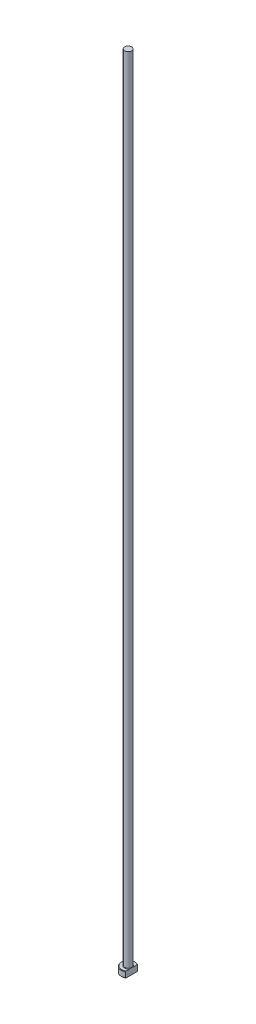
ISO-10303-21;
HEADER;
FILE_DESCRIPTION(('STEP AP214'),'2;1');
FILE_NAME('part.step','',(''),(''),'','','');
FILE_SCHEMA(('AUTOMOTIVE_DESIGN { 1 0 10303 214 1 1 1 1 }'));
ENDSEC;
DATA;
#1=APPLICATION_CONTEXT('core data for automotive mechanical design processes');
#2=APPLICATION_PROTOCOL_DEFINITION('international standard','automotive_design',2000,#1);
#3=PRODUCT_CONTEXT('',#1,'mechanical');
#4=PRODUCT('Part','Part','',(#3));
#5=PRODUCT_RELATED_PRODUCT_CATEGORY('part','',(#4));
#6=PRODUCT_DEFINITION_FORMATION('','',#4);
#7=PRODUCT_DEFINITION_CONTEXT('part definition',#1,'design');
#8=PRODUCT_DEFINITION('design','',#6,#7);
#9=PRODUCT_DEFINITION_SHAPE('','',#8);
#10=(LENGTH_UNIT() NAMED_UNIT(*) SI_UNIT(.MILLI.,.METRE.));
#11=(NAMED_UNIT(*) PLANE_ANGLE_UNIT() SI_UNIT($,.RADIAN.));
#12=(NAMED_UNIT(*) SI_UNIT($,.STERADIAN.) SOLID_ANGLE_UNIT());
#13=UNCERTAINTY_MEASURE_WITH_UNIT(LENGTH_MEASURE(1.E-05),#10,'distance_accuracy_value','');
#14=(GEOMETRIC_REPRESENTATION_CONTEXT(3) GLOBAL_UNCERTAINTY_ASSIGNED_CONTEXT((#13)) GLOBAL_UNIT_ASSIGNED_CONTEXT((#10,
#11,#12)) REPRESENTATION_CONTEXT('',''));
#15=CARTESIAN_POINT('',(0.,0.,0.));
#16=DIRECTION('',(0.,0.,1.));
#17=DIRECTION('',(1.,0.,0.));
#18=AXIS2_PLACEMENT_3D('',#15,#16,#17);
#19=CARTESIAN_POINT('',(0.,0.,0.));
#20=DIRECTION('',(0.,-1.,0.));
#21=DIRECTION('',(0.,0.,-1.));
#22=AXIS2_PLACEMENT_3D('',#19,#20,#21);
#23=PLANE('',#22);
#24=CARTESIAN_POINT('',(0.,0.,0.));
#25=DIRECTION('',(0.,-1.,0.));
#26=DIRECTION('',(0.,0.,-1.));
#27=AXIS2_PLACEMENT_3D('',#24,#25,#26);
#28=CIRCLE('',#27,3.29999999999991);
#29=CARTESIAN_POINT('',(1.74999999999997,0.,2.79776696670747));
#30=VERTEX_POINT('',#29);
#31=CARTESIAN_POINT('',(1.74999999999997,0.,-2.79776696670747));
#32=VERTEX_POINT('',#31);
#33=EDGE_CURVE('E98',#30,#32,#28,.T.);
#34=ORIENTED_EDGE('',*,*,#33,.T.);
#35=DIRECTION('',(0.,0.,1.));
#36=VECTOR('',#35,1.);
#37=CARTESIAN_POINT('',(1.74999999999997,0.,-3.03108891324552));
#38=LINE('',#37,#36);
#39=EDGE_CURVE('E83',#32,#30,#38,.T.);
#40=ORIENTED_EDGE('',*,*,#39,.T.);
#41=EDGE_LOOP('',(#34,#40));
#42=FACE_BOUND('',#41,.T.);
#43=ADVANCED_FACE('F32',(#42),#23,.T.);
#44=CARTESIAN_POINT('',(0.,259.958771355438,0.));
#45=DIRECTION('',(0.,1.,0.));
#46=DIRECTION('',(0.,0.,1.));
#47=AXIS2_PLACEMENT_3D('',#44,#45,#46);
#48=CYLINDRICAL_SURFACE('',#47,3.49999999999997);
#49=CARTESIAN_POINT('',(0.,2.80000000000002,0.));
#50=DIRECTION('',(0.,1.,0.));
#51=DIRECTION('',(0.,0.,1.));
#52=AXIS2_PLACEMENT_3D('',#49,#50,#51);
#53=CIRCLE('',#52,3.49999999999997);
#54=CARTESIAN_POINT('',(1.74999999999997,2.80000000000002,3.03108891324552));
#55=VERTEX_POINT('',#54);
#56=CARTESIAN_POINT('',(1.74999999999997,2.80000000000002,-3.03108891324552));
#57=VERTEX_POINT('',#56);
#58=EDGE_CURVE('E104',#55,#57,#53,.F.);
#59=ORIENTED_EDGE('',*,*,#58,.T.);
#60=DIRECTION('',(0.,-1.,0.));
#61=VECTOR('',#60,1.);
#62=CARTESIAN_POINT('',(1.74999999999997,400.,-3.03108891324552));
#63=LINE('',#62,#61);
#64=CARTESIAN_POINT('',(1.74999999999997,0.200000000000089,-3.03108891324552));
#65=VERTEX_POINT('',#64);
#66=EDGE_CURVE('E183',#57,#65,#63,.T.);
#67=ORIENTED_EDGE('',*,*,#66,.T.);
#68=CARTESIAN_POINT('',(0.,0.200000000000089,0.));
#69=DIRECTION('',(0.,-1.,0.));
#70=DIRECTION('',(0.,0.,-1.));
#71=AXIS2_PLACEMENT_3D('',#68,#69,#70);
#72=CIRCLE('',#71,3.49999999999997);
#73=CARTESIAN_POINT('',(1.74999999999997,0.200000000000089,3.03108891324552));
#74=VERTEX_POINT('',#73);
#75=EDGE_CURVE('E100',#65,#74,#72,.F.);
#76=ORIENTED_EDGE('',*,*,#75,.T.);
#77=DIRECTION('',(0.,-1.,0.));
#78=VECTOR('',#77,1.);
#79=CARTESIAN_POINT('',(1.74999999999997,400.,3.03108891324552));
#80=LINE('',#79,#78);
#81=EDGE_CURVE('E93',#55,#74,#80,.T.);
#82=ORIENTED_EDGE('',*,*,#81,.F.);
#83=EDGE_LOOP('',(#59,#67,#76,#82));
#84=FACE_BOUND('',#83,.T.);
#85=ADVANCED_FACE('F158',(#84),#48,.T.);
#86=CARTESIAN_POINT('',(-3.49999999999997,3.,0.));
#87=DIRECTION('',(0.,1.,0.));
#88=DIRECTION('',(0.,0.,1.));
#89=AXIS2_PLACEMENT_3D('',#86,#87,#88);
#90=PLANE('',#89);
#91=CARTESIAN_POINT('',(0.,3.,0.));
#92=DIRECTION('',(0.,1.,0.));
#93=DIRECTION('',(0.,0.,1.));
#94=AXIS2_PLACEMENT_3D('',#91,#92,#93);
#95=CIRCLE('',#94,3.29999999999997);
#96=CARTESIAN_POINT('',(1.74999999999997,3.,-2.79776696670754));
#97=VERTEX_POINT('',#96);
#98=CARTESIAN_POINT('',(1.74999999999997,3.,2.79776696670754));
#99=VERTEX_POINT('',#98);
#100=EDGE_CURVE('E178',#97,#99,#95,.T.);
#101=ORIENTED_EDGE('',*,*,#100,.T.);
#102=DIRECTION('',(0.,0.,-1.));
#103=VECTOR('',#102,1.);
#104=CARTESIAN_POINT('',(1.74999999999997,3.,0.));
#105=LINE('',#104,#103);
#106=CARTESIAN_POINT('',(1.74999999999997,2.99999999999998,0.860232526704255));
#107=VERTEX_POINT('',#106);
#108=EDGE_CURVE('E57',#99,#107,#105,.T.);
#109=ORIENTED_EDGE('',*,*,#108,.T.);
#110=CARTESIAN_POINT('',(0.,3.,0.));
#111=DIRECTION('',(0.,1.,0.));
#112=DIRECTION('',(0.,0.,1.));
#113=AXIS2_PLACEMENT_3D('',#110,#111,#112);
#114=CIRCLE('',#113,1.94999999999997);
#115=CARTESIAN_POINT('',(1.74999999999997,2.99999999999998,-0.860232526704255));
#116=VERTEX_POINT('',#115);
#117=EDGE_CURVE('E107',#107,#116,#114,.F.);
#118=ORIENTED_EDGE('',*,*,#117,.T.);
#119=EDGE_CURVE('E136',#116,#97,#105,.T.);
#120=ORIENTED_EDGE('',*,*,#119,.T.);
#121=EDGE_LOOP('',(#101,#109,#118,#120));
#122=FACE_BOUND('',#121,.T.);
#123=ADVANCED_FACE('F147',(#122),#90,.T.);
#124=CARTESIAN_POINT('',(0.,3.,0.));
#125=DIRECTION('',(0.,-1.,0.));
#126=DIRECTION('',(0.,0.,-1.));
#127=AXIS2_PLACEMENT_3D('',#124,#125,#126);
#128=CONICAL_SURFACE('',#127,3.29999999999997,0.785398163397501);
#129=ORIENTED_EDGE('',*,*,#58,.F.);
#130=CARTESIAN_POINT('',(1.74999999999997,-0.596308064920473,6.67057455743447));
#131=CARTESIAN_POINT('',(1.74999999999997,-0.450097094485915,6.51940719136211));
#132=CARTESIAN_POINT('',(1.74999999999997,-0.304043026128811,6.36808756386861));
#133=CARTESIAN_POINT('',(1.74999999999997,-0.0123415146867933,6.06505321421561));
#134=CARTESIAN_POINT('',(1.74999999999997,0.133305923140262,5.91333848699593));
#135=CARTESIAN_POINT('',(1.74999999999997,0.424172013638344,5.60934946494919));
#136=CARTESIAN_POINT('',(1.74999999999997,0.569390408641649,5.45707492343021));
#137=CARTESIAN_POINT('',(1.74999999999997,0.85918520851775,5.15191761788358));
#138=CARTESIAN_POINT('',(1.74999999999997,1.0037616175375,4.9990348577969));
#139=CARTESIAN_POINT('',(1.74999999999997,1.28922437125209,4.69552747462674));
#140=CARTESIAN_POINT('',(1.74999999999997,1.43012702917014,4.54491820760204));
#141=CARTESIAN_POINT('',(1.74999999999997,1.71087777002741,4.24272028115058));
#142=CARTESIAN_POINT('',(1.74999999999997,1.85072585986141,4.0911316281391));
#143=CARTESIAN_POINT('',(1.74999999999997,2.12895853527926,3.78667524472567));
#144=CARTESIAN_POINT('',(1.74999999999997,2.26734342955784,3.63380779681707));
#145=CARTESIAN_POINT('',(1.74999999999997,2.54209958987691,3.32627683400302));
#146=CARTESIAN_POINT('',(1.74999999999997,2.67847093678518,3.17161339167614));
#147=CARTESIAN_POINT('',(1.74999999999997,2.8961728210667,2.91990258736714));
#148=CARTESIAN_POINT('',(1.74999999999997,2.97843114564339,2.82365864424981));
#149=CARTESIAN_POINT('',(1.74999999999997,3.14148360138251,2.62991861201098));
#150=CARTESIAN_POINT('',(1.74999999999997,3.22227758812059,2.53242240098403));
#151=CARTESIAN_POINT('',(1.74999999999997,3.38274452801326,2.33479038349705));
#152=CARTESIAN_POINT('',(1.74999999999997,3.46239661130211,2.23463757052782));
#153=CARTESIAN_POINT('',(1.74999999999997,3.61891495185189,2.03220225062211));
#154=CARTESIAN_POINT('',(1.74999999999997,3.6957818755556,1.92992026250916));
#155=CARTESIAN_POINT('',(1.74999999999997,3.84669654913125,1.72090511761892));
#156=CARTESIAN_POINT('',(1.74999999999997,3.92068375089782,1.61412795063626));
#157=CARTESIAN_POINT('',(1.74999999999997,4.06269616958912,1.39638381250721));
#158=CARTESIAN_POINT('',(1.74999999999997,4.13071318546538,1.28541136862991));
#159=CARTESIAN_POINT('',(1.74999999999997,4.22516490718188,1.11561175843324));
#160=CARTESIAN_POINT('',(1.74999999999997,4.25522351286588,1.058816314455));
#161=CARTESIAN_POINT('',(1.74999999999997,4.31237042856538,0.943756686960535));
#162=CARTESIAN_POINT('',(1.74999999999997,4.33945819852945,0.885492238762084));
#163=CARTESIAN_POINT('',(1.74999999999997,4.41499290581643,0.708569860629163));
#164=CARTESIAN_POINT('',(1.74999999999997,4.45796078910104,0.587356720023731));
#165=CARTESIAN_POINT('',(1.74999999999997,4.50447230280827,0.405622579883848));
#166=CARTESIAN_POINT('',(1.74999999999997,4.51680920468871,0.347327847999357));
#167=CARTESIAN_POINT('',(1.74999999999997,4.53592536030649,0.229813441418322));
#168=CARTESIAN_POINT('',(1.74999999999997,4.54270510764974,0.170593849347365));
#169=CARTESIAN_POINT('',(1.74999999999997,4.55022681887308,0.051951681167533));
#170=CARTESIAN_POINT('',(1.74999999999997,4.55098747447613,-0.00746969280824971));
#171=CARTESIAN_POINT('',(1.74999999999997,4.5464654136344,-0.126082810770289));
#172=CARTESIAN_POINT('',(1.74999999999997,4.54118219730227,-0.18527453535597));
#173=CARTESIAN_POINT('',(1.74999999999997,4.52501178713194,-0.302357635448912));
#174=CARTESIAN_POINT('',(1.74999999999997,4.51417270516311,-0.360255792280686));
#175=CARTESIAN_POINT('',(1.74999999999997,4.48756668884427,-0.474896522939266));
#176=CARTESIAN_POINT('',(1.74999999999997,4.47179916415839,-0.531638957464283));
#177=CARTESIAN_POINT('',(1.74999999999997,4.43599695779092,-0.64410319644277));
#178=CARTESIAN_POINT('',(1.74999999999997,4.41593824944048,-0.699817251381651));
#179=CARTESIAN_POINT('',(1.74999999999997,4.37235913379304,-0.809843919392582));
#180=CARTESIAN_POINT('',(1.74999999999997,4.348839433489,-0.864156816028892));
#181=CARTESIAN_POINT('',(1.74999999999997,4.27385837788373,-1.0256237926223));
#182=CARTESIAN_POINT('',(1.74999999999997,4.21814894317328,-1.13079943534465));
#183=CARTESIAN_POINT('',(1.74999999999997,4.09935726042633,-1.33694307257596));
#184=CARTESIAN_POINT('',(1.74999999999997,4.03626572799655,-1.43790554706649));
#185=CARTESIAN_POINT('',(1.74999999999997,3.90490246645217,-1.63694628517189));
#186=CARTESIAN_POINT('',(1.74999999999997,3.83661129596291,-1.73501160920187));
#187=CARTESIAN_POINT('',(1.74999999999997,3.69663576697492,-1.92859117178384));
#188=CARTESIAN_POINT('',(1.74999999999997,3.62495312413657,-2.02410666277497));
#189=CARTESIAN_POINT('',(1.74999999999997,3.47817312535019,-2.21448054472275));
#190=CARTESIAN_POINT('',(1.74999999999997,3.4030432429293,-2.30931373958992));
#191=CARTESIAN_POINT('',(1.74999999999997,3.25092223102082,-2.49748629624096));
#192=CARTESIAN_POINT('',(1.74999999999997,3.17393090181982,-2.59082549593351));
#193=CARTESIAN_POINT('',(1.74999999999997,3.01873588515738,-2.77610276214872));
#194=CARTESIAN_POINT('',(1.74999999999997,2.94053559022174,-2.8680436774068));
#195=CARTESIAN_POINT('',(1.74999999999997,2.78305359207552,-3.05099558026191));
#196=CARTESIAN_POINT('',(1.74999999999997,2.70377186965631,-3.14200655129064));
#197=CARTESIAN_POINT('',(1.74999999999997,2.4917775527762,-3.38307713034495));
#198=CARTESIAN_POINT('',(1.74999999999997,2.3583209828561,-3.53248201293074));
#199=CARTESIAN_POINT('',(1.74999999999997,2.08977689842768,-3.82982116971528));
#200=CARTESIAN_POINT('',(1.74999999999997,1.95468933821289,-3.97775540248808));
#201=CARTESIAN_POINT('',(1.74999999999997,1.68319766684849,-4.27266697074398));
#202=CARTESIAN_POINT('',(1.74999999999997,1.5467924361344,-4.41964327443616));
#203=CARTESIAN_POINT('',(1.74999999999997,1.27308598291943,-4.71275937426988));
#204=CARTESIAN_POINT('',(1.74999999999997,1.13578475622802,-4.85889916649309));
#205=CARTESIAN_POINT('',(1.74999999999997,0.734183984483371,-5.28435414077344));
#206=CARTESIAN_POINT('',(1.74999999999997,0.468971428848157,-5.56280727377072));
#207=CARTESIAN_POINT('',(1.74999999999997,0.0701049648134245,-5.97918348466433));
#208=CARTESIAN_POINT('',(1.74999999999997,-0.0629507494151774,-6.11768155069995));
#209=CARTESIAN_POINT('',(1.74999999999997,-0.329395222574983,-6.39435480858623));
#210=CARTESIAN_POINT('',(1.74999999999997,-0.462783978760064,-6.53253000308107));
#211=CARTESIAN_POINT('',(1.74999999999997,-0.596308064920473,-6.67057455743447));
#212=B_SPLINE_CURVE_WITH_KNOTS('',3,(#130,#131,#132,#133,#134,#135,#136,#137,#138,#139,#140,
#141,#142,#143,#144,#145,#146,#147,#148,#149,#150,#151,#152,#153,#154,#155,#156,#157,#158,#159,
#160,#161,#162,#163,#164,#165,#166,#167,#168,#169,#170,#171,#172,#173,#174,#175,#176,#177,#178,
#179,#180,#181,#182,#183,#184,#185,#186,#187,#188,#189,#190,#191,#192,#193,#194,#195,#196,#197,
#198,#199,#200,#201,#202,#203,#204,#205,#206,#207,#208,#209,#210,#211),.UNSPECIFIED.,.F.,.F.,(4,
2,2,2,2,2,2,2,2,2,2,2,2,2,2,2,2,2,2,2,2,2,2,2,2,2,2,2,2,2,2,2,2,2,2,2,2,2,2,2,4),(0.,
0.630922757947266,1.26185363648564,1.89310749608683,2.52435727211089,3.14308654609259,
3.76181177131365,4.38040374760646,4.9989708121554,5.37878108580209,5.7586286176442,
6.14249031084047,6.52625953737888,6.91585739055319,7.30598230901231,7.49867618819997,
7.69140503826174,8.07538783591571,8.25392686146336,8.43245002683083,8.61041858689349,
8.78840186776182,8.96486927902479,9.14135783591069,9.31886171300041,9.49632938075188,
9.85286274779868,10.2098494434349,10.5682434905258,10.9264581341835,11.2893876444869,
11.6523562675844,12.0144447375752,12.3765396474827,12.9775131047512,13.5785034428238,
14.1800594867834,14.7816183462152,15.9352370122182,16.51140505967,17.0875683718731),.UNSPECIFIED.);
#213=EDGE_CURVE('E135',#55,#99,#212,.T.);
#214=ORIENTED_EDGE('',*,*,#213,.T.);
#215=ORIENTED_EDGE('',*,*,#100,.F.);
#216=EDGE_CURVE('E127',#97,#57,#212,.T.);
#217=ORIENTED_EDGE('',*,*,#216,.T.);
#218=EDGE_LOOP('',(#129,#214,#215,#217));
#219=FACE_BOUND('',#218,.T.);
#220=ADVANCED_FACE('F143',(#219),#128,.T.);
#221=CARTESIAN_POINT('',(0.,0.200000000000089,0.));
#222=DIRECTION('',(0.,1.,0.));
#223=DIRECTION('',(0.,0.,1.));
#224=AXIS2_PLACEMENT_3D('',#221,#222,#223);
#225=CONICAL_SURFACE('',#224,3.49999999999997,0.78539816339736);
#226=ORIENTED_EDGE('',*,*,#75,.F.);
#227=CARTESIAN_POINT('',(1.74999999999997,3.59630806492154,-6.67057455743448));
#228=CARTESIAN_POINT('',(1.74999999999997,3.45009709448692,-6.51940719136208));
#229=CARTESIAN_POINT('',(1.74999999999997,3.30404302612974,-6.36808756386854));
#230=CARTESIAN_POINT('',(1.74999999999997,3.01234151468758,-6.06505321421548));
#231=CARTESIAN_POINT('',(1.74999999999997,2.86669407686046,-5.91333848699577));
#232=CARTESIAN_POINT('',(1.74999999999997,2.57582798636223,-5.60934946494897));
#233=CARTESIAN_POINT('',(1.74999999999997,2.43060959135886,-5.45707492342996));
#234=CARTESIAN_POINT('',(1.74999999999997,2.14081479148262,-5.15191761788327));
#235=CARTESIAN_POINT('',(1.74999999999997,1.9962383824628,-4.99903485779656));
#236=CARTESIAN_POINT('',(1.74999999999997,1.71077562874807,-4.69552747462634));
#237=CARTESIAN_POINT('',(1.74999999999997,1.56987297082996,-4.54491820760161));
#238=CARTESIAN_POINT('',(1.74999999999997,1.28912222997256,-4.24272028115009));
#239=CARTESIAN_POINT('',(1.74999999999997,1.1492741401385,-4.09113162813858));
#240=CARTESIAN_POINT('',(1.74999999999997,0.871041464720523,-3.78667524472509));
#241=CARTESIAN_POINT('',(1.74999999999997,0.732656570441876,-3.63380779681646));
#242=CARTESIAN_POINT('',(1.74999999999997,0.45790041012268,-3.32627683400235));
#243=CARTESIAN_POINT('',(1.74999999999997,0.321529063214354,-3.17161339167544));
#244=CARTESIAN_POINT('',(1.74999999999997,0.103827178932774,-2.91990258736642));
#245=CARTESIAN_POINT('',(1.74999999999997,0.0215688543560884,-2.82365864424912));
#246=CARTESIAN_POINT('',(1.74999999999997,-0.141483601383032,-2.62991861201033));
#247=CARTESIAN_POINT('',(1.74999999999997,-0.222277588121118,-2.5324224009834));
#248=CARTESIAN_POINT('',(1.74999999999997,-0.382744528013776,-2.33479038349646));
#249=CARTESIAN_POINT('',(1.74999999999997,-0.462396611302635,-2.23463757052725));
#250=CARTESIAN_POINT('',(1.74999999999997,-0.618914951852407,-2.03220225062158));
#251=CARTESIAN_POINT('',(1.74999999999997,-0.695781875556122,-1.92992026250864));
#252=CARTESIAN_POINT('',(1.74999999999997,-0.846696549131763,-1.72090511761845));
#253=CARTESIAN_POINT('',(1.74999999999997,-0.920683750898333,-1.61412795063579));
#254=CARTESIAN_POINT('',(1.74999999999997,-1.06269616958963,-1.39638381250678));
#255=CARTESIAN_POINT('',(1.74999999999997,-1.13071318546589,-1.2854113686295));
#256=CARTESIAN_POINT('',(1.74999999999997,-1.22516490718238,-1.11561175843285));
#257=CARTESIAN_POINT('',(1.74999999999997,-1.25522351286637,-1.05881631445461));
#258=CARTESIAN_POINT('',(1.74999999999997,-1.31237042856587,-0.943756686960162));
#259=CARTESIAN_POINT('',(1.74999999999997,-1.33945819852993,-0.885492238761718));
#260=CARTESIAN_POINT('',(1.74999999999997,-1.4149929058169,-0.708569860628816));
#261=CARTESIAN_POINT('',(1.74999999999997,-1.4579607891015,-0.587356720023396));
#262=CARTESIAN_POINT('',(1.74999999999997,-1.50447230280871,-0.405622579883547));
#263=CARTESIAN_POINT('',(1.74999999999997,-1.51680920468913,-0.347327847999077));
#264=CARTESIAN_POINT('',(1.74999999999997,-1.53592536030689,-0.229813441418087));
#265=CARTESIAN_POINT('',(1.74999999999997,-1.54270510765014,-0.170593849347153));
#266=CARTESIAN_POINT('',(1.74999999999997,-1.55022681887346,-0.0519516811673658));
#267=CARTESIAN_POINT('',(1.74999999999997,-1.55098747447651,0.00746969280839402));
#268=CARTESIAN_POINT('',(1.74999999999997,-1.54646541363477,0.126082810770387));
#269=CARTESIAN_POINT('',(1.74999999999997,-1.54118219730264,0.185274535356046));
#270=CARTESIAN_POINT('',(1.74999999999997,-1.5250117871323,0.302357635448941));
#271=CARTESIAN_POINT('',(1.74999999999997,-1.51417270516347,0.360255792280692));
#272=CARTESIAN_POINT('',(1.74999999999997,-1.48756668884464,0.474896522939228));
#273=CARTESIAN_POINT('',(1.74999999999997,-1.47179916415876,0.531638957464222));
#274=CARTESIAN_POINT('',(1.74999999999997,-1.4359969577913,0.644103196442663));
#275=CARTESIAN_POINT('',(1.74999999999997,-1.41593824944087,0.699817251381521));
#276=CARTESIAN_POINT('',(1.74999999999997,-1.37235913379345,0.809843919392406));
#277=CARTESIAN_POINT('',(1.74999999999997,-1.34883943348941,0.864156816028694));
#278=CARTESIAN_POINT('',(1.74999999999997,-1.27385837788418,1.02562379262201));
#279=CARTESIAN_POINT('',(1.74999999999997,-1.21814894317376,1.13079943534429));
#280=CARTESIAN_POINT('',(1.74999999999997,-1.09935726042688,1.33694307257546));
#281=CARTESIAN_POINT('',(1.74999999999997,-1.03626572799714,1.43790554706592));
#282=CARTESIAN_POINT('',(1.74999999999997,-0.904902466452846,1.63694628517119));
#283=CARTESIAN_POINT('',(1.74999999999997,-0.836611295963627,1.7350116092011));
#284=CARTESIAN_POINT('',(1.74999999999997,-0.696635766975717,1.92859117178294));
#285=CARTESIAN_POINT('',(1.74999999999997,-0.624953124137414,2.02410666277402));
#286=CARTESIAN_POINT('',(1.74999999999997,-0.478173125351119,2.21448054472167));
#287=CARTESIAN_POINT('',(1.74999999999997,-0.403043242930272,2.30931373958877));
#288=CARTESIAN_POINT('',(1.74999999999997,-0.250922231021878,2.49748629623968));
#289=CARTESIAN_POINT('',(1.74999999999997,-0.173930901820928,2.59082549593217));
#290=CARTESIAN_POINT('',(1.74999999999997,-0.018735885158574,2.77610276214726));
#291=CARTESIAN_POINT('',(1.74999999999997,0.0594644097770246,2.86804367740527));
#292=CARTESIAN_POINT('',(1.74999999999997,0.216946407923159,3.05099558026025));
#293=CARTESIAN_POINT('',(1.74999999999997,0.296228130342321,3.14200655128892));
#294=CARTESIAN_POINT('',(1.74999999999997,0.508222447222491,3.38307713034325));
#295=CARTESIAN_POINT('',(1.74999999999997,0.641679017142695,3.53248201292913));
#296=CARTESIAN_POINT('',(1.74999999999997,0.910223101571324,3.82982116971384));
#297=CARTESIAN_POINT('',(1.74999999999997,1.04531066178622,3.97775540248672));
#298=CARTESIAN_POINT('',(1.74999999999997,1.31680233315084,4.27266697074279));
#299=CARTESIAN_POINT('',(1.74999999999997,1.45320756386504,4.41964327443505));
#300=CARTESIAN_POINT('',(1.74999999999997,1.72691401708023,4.71275937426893));
#301=CARTESIAN_POINT('',(1.74999999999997,1.86421524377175,4.85889916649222));
#302=CARTESIAN_POINT('',(1.74999999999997,2.2658160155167,5.28435414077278));
#303=CARTESIAN_POINT('',(1.74999999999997,2.53102857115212,5.5628072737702));
#304=CARTESIAN_POINT('',(1.74999999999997,2.92989503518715,5.979183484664));
#305=CARTESIAN_POINT('',(1.74999999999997,3.06295074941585,6.11768155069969));
#306=CARTESIAN_POINT('',(1.74999999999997,3.32939522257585,6.3943548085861));
#307=CARTESIAN_POINT('',(1.74999999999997,3.46278397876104,6.532530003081));
#308=CARTESIAN_POINT('',(1.74999999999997,3.59630806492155,6.67057455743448));
#309=B_SPLINE_CURVE_WITH_KNOTS('',3,(#227,#228,#229,#230,#231,#232,#233,#234,#235,#236,#237,
#238,#239,#240,#241,#242,#243,#244,#245,#246,#247,#248,#249,#250,#251,#252,#253,#254,#255,#256,
#257,#258,#259,#260,#261,#262,#263,#264,#265,#266,#267,#268,#269,#270,#271,#272,#273,#274,#275,
#276,#277,#278,#279,#280,#281,#282,#283,#284,#285,#286,#287,#288,#289,#290,#291,#292,#293,#294,
#295,#296,#297,#298,#299,#300,#301,#302,#303,#304,#305,#306,#307,#308),.UNSPECIFIED.,.F.,.F.,(4,
2,2,2,2,2,2,2,2,2,2,2,2,2,2,2,2,2,2,2,2,2,2,2,2,2,2,2,2,2,2,2,2,2,2,2,2,2,2,2,4),(0.,
0.630922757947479,1.26185363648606,1.89310749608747,2.52435727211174,3.14308654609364,
3.76181177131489,4.3804037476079,4.99897081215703,5.37878108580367,5.75862861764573,
6.14249031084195,6.52625953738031,6.91585739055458,7.30598230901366,7.4986761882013,
7.69140503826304,8.07538783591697,8.25392686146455,8.43245002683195,8.61041858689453,
8.7884018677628,8.9648692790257,9.14135783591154,9.31886171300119,9.49632938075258,
9.85286274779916,10.2098494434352,10.5682434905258,10.9264581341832,11.2893876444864,
11.6523562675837,12.0144447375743,12.3765396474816,12.9775131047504,13.5785034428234,
14.1800594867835,14.7816183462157,15.9352370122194,16.5114050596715,17.087568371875),.UNSPECIFIED.);
#310=EDGE_CURVE('E86',#65,#32,#309,.T.);
#311=ORIENTED_EDGE('',*,*,#310,.T.);
#312=ORIENTED_EDGE('',*,*,#33,.F.);
#313=EDGE_CURVE('E89',#30,#74,#309,.T.);
#314=ORIENTED_EDGE('',*,*,#313,.T.);
#315=EDGE_LOOP('',(#226,#311,#312,#314));
#316=FACE_BOUND('',#315,.T.);
#317=ADVANCED_FACE('F97',(#316),#225,.T.);
#318=CARTESIAN_POINT('',(0.,3.19999999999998,0.));
#319=DIRECTION('',(0.,1.,0.));
#320=DIRECTION('',(0.,0.,1.));
#321=AXIS2_PLACEMENT_3D('',#318,#319,#320);
#322=TOROIDAL_SURFACE('',#321,1.94999999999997,0.2);
#323=CARTESIAN_POINT('',(1.74999999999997,3.19999999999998,0.));
#324=CARTESIAN_POINT('',(1.74999999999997,3.20000050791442,9.38679694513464E-11));
#325=CARTESIAN_POINT('',(1.74999999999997,3.20000101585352,-1.34501098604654E-07));
#326=CARTESIAN_POINT('',(1.74999999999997,3.20000198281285,-5.41283468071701E-07));
#327=CARTESIAN_POINT('',(1.74999999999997,3.20000243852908,-8.19487700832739E-07));
#328=CARTESIAN_POINT('',(1.74999999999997,3.20000335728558,-1.4843911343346E-06));
#329=CARTESIAN_POINT('',(1.74999999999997,3.20000381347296,-1.88052630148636E-06));
#330=CARTESIAN_POINT('',(1.74999999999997,3.20000466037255,-2.72280863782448E-06));
#331=CARTESIAN_POINT('',(1.74999999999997,3.20000505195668,-3.16812551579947E-06));
#332=CARTESIAN_POINT('',(1.74999999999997,3.20000641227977,-4.80772278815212E-06));
#333=CARTESIAN_POINT('',(1.74999999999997,3.20000730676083,-6.06508167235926E-06));
#334=CARTESIAN_POINT('',(1.74999999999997,3.20000885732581,-8.62364306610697E-06));
#335=CARTESIAN_POINT('',(1.74999999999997,3.20000952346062,-9.91907764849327E-06));
#336=CARTESIAN_POINT('',(1.74999999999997,3.20001212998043,-1.51310765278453E-05));
#337=CARTESIAN_POINT('',(1.74999999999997,3.20001395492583,-1.91092654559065E-05));
#338=CARTESIAN_POINT('',(1.74999999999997,3.2000168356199,-2.68327805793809E-05));
#339=CARTESIAN_POINT('',(1.74999999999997,3.20001795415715,-3.05551299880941E-05));
#340=CARTESIAN_POINT('',(1.74999999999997,3.20002287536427,-4.68261372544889E-05));
#341=CARTESIAN_POINT('',(1.74999999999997,3.20002674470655,-5.93446276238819E-05));
#342=CARTESIAN_POINT('',(1.74999999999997,3.20003278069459,-8.25255939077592E-05));
#343=CARTESIAN_POINT('',(1.74999999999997,3.20003512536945,-9.31393220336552E-05));
#344=CARTESIAN_POINT('',(1.74999999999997,3.20005413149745,-0.00017197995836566));
#345=CARTESIAN_POINT('',(1.74999999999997,3.20007897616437,-0.000237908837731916));
#346=CARTESIAN_POINT('',(1.74999999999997,3.20017305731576,-0.000496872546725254));
#347=CARTESIAN_POINT('',(1.74999999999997,3.20023617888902,-0.00069150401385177));
#348=CARTESIAN_POINT('',(1.74999999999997,3.20048774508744,-0.00145613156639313));
#349=CARTESIAN_POINT('',(1.74999999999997,3.20068259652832,-0.00202450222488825));
#350=CARTESIAN_POINT('',(1.74999999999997,3.20148279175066,-0.0043694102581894));
#351=CARTESIAN_POINT('',(1.74999999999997,3.20208089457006,-0.00614773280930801));
#352=CARTESIAN_POINT('',(1.74999999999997,3.20853845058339,-0.0253339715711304));
#353=CARTESIAN_POINT('',(1.74999999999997,3.21443574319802,-0.0427328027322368));
#354=CARTESIAN_POINT('',(1.74999999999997,3.22594434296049,-0.0768841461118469));
#355=CARTESIAN_POINT('',(1.74999999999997,3.2315579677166,-0.0936359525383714));
#356=CARTESIAN_POINT('',(1.74999999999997,3.24339960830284,-0.129193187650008));
#357=CARTESIAN_POINT('',(1.74999999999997,3.24961959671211,-0.148001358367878));
#358=CARTESIAN_POINT('',(1.74999999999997,3.26199268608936,-0.185858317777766));
#359=CARTESIAN_POINT('',(1.74999999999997,3.26814439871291,-0.204907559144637));
#360=CARTESIAN_POINT('',(1.74999999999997,3.28302129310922,-0.251728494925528));
#361=CARTESIAN_POINT('',(1.74999999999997,3.29164632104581,-0.279532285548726));
#362=CARTESIAN_POINT('',(1.74999999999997,3.30815507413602,-0.334622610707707));
#363=CARTESIAN_POINT('',(1.74999999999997,3.31605173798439,-0.361905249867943));
#364=CARTESIAN_POINT('',(1.74999999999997,3.33270110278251,-0.422187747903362));
#365=CARTESIAN_POINT('',(1.74999999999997,3.34130455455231,-0.4552293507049));
#366=CARTESIAN_POINT('',(1.74999999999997,3.35728256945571,-0.521873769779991));
#367=CARTESIAN_POINT('',(1.74999999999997,3.36464748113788,-0.555478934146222));
#368=CARTESIAN_POINT('',(1.74999999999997,3.37810121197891,-0.62522543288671));
#369=CARTESIAN_POINT('',(1.74999999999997,3.38407559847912,-0.661389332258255));
#370=CARTESIAN_POINT('',(1.74999999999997,3.39348021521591,-0.733973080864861));
#371=CARTESIAN_POINT('',(1.74999999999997,3.39691695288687,-0.770392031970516));
#372=CARTESIAN_POINT('',(1.74999999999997,3.39990626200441,-0.832262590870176));
#373=CARTESIAN_POINT('',(1.74999999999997,3.40032395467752,-0.85767040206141));
#374=CARTESIAN_POINT('',(1.74999999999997,3.39916217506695,-0.908260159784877));
#375=CARTESIAN_POINT('',(1.74999999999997,3.39759783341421,-0.933442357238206));
#376=CARTESIAN_POINT('',(1.74999999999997,3.39129859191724,-0.989903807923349));
#377=CARTESIAN_POINT('',(1.74999999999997,3.38586007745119,-1.02110925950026));
#378=CARTESIAN_POINT('',(1.74999999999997,3.36964168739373,-1.08216800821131));
#379=CARTESIAN_POINT('',(1.74999999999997,3.35888918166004,-1.11202738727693));
#380=CARTESIAN_POINT('',(1.74999999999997,3.33961802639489,-1.14878048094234));
#381=CARTESIAN_POINT('',(1.74999999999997,3.33455492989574,-1.15748014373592));
#382=CARTESIAN_POINT('',(1.74999999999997,3.32351587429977,-1.1742966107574));
#383=CARTESIAN_POINT('',(1.74999999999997,3.31753946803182,-1.18241312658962));
#384=CARTESIAN_POINT('',(1.74999999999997,3.30451428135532,-1.19787793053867));
#385=CARTESIAN_POINT('',(1.74999999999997,3.29745609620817,-1.20521842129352));
#386=CARTESIAN_POINT('',(1.74999999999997,3.2822352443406,-1.21865698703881));
#387=CARTESIAN_POINT('',(1.74999999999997,3.27407476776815,-1.22475746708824));
#388=CARTESIAN_POINT('',(1.74999999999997,3.25920166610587,-1.23370537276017));
#389=CARTESIAN_POINT('',(1.74999999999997,3.25274944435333,-1.23698363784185));
#390=CARTESIAN_POINT('',(1.74999999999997,3.23939659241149,-1.24245066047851));
#391=CARTESIAN_POINT('',(1.74999999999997,3.23249637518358,-1.2446404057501));
#392=CARTESIAN_POINT('',(1.74999999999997,3.21836445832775,-1.24776583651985));
#393=CARTESIAN_POINT('',(1.74999999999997,3.21113087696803,-1.24869317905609));
#394=CARTESIAN_POINT('',(1.74999999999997,3.19661788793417,-1.24917680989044));
#395=CARTESIAN_POINT('',(1.74999999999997,3.18933848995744,-1.2487333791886));
#396=CARTESIAN_POINT('',(1.74999999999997,3.17564813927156,-1.2466228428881));
#397=CARTESIAN_POINT('',(1.74999999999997,3.16921873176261,-1.24507159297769));
#398=CARTESIAN_POINT('',(1.74999999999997,3.1566813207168,-1.24099086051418));
#399=CARTESIAN_POINT('',(1.74999999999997,3.15057343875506,-1.23846101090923));
#400=CARTESIAN_POINT('',(1.74999999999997,3.13656990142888,-1.23147130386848));
#401=CARTESIAN_POINT('',(1.74999999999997,3.1288582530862,-1.2266435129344));
#402=CARTESIAN_POINT('',(1.74999999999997,3.11430996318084,-1.21581214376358));
#403=CARTESIAN_POINT('',(1.74999999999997,3.10747539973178,-1.20980585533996));
#404=CARTESIAN_POINT('',(1.74999999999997,3.09141283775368,-1.19367262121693));
#405=CARTESIAN_POINT('',(1.74999999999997,3.0827335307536,-1.18300273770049));
#406=CARTESIAN_POINT('',(1.74999999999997,3.06710756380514,-1.16049397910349));
#407=CARTESIAN_POINT('',(1.74999999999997,3.06016260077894,-1.14865397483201));
#408=CARTESIAN_POINT('',(1.74999999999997,3.04314403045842,-1.11526045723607));
#409=CARTESIAN_POINT('',(1.74999999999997,3.03452872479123,-1.09297031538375));
#410=CARTESIAN_POINT('',(1.74999999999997,3.0205187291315,-1.04724849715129));
#411=CARTESIAN_POINT('',(1.74999999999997,3.01515578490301,-1.02380790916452));
#412=CARTESIAN_POINT('',(1.74999999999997,3.00698483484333,-0.976403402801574));
#413=CARTESIAN_POINT('',(1.74999999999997,3.00418732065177,-0.952437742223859));
#414=CARTESIAN_POINT('',(1.74999999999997,3.00064912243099,-0.9043219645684));
#415=CARTESIAN_POINT('',(1.74999999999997,2.99991269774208,-0.880171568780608));
#416=CARTESIAN_POINT('',(1.74999999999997,3.00019275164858,-0.809643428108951));
#417=CARTESIAN_POINT('',(1.74999999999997,3.00344813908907,-0.763278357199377));
#418=CARTESIAN_POINT('',(1.74999999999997,3.01492484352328,-0.664825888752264));
#419=CARTESIAN_POINT('',(1.74999999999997,3.02376250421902,-0.612819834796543));
#420=CARTESIAN_POINT('',(1.74999999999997,3.04538488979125,-0.508370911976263));
#421=CARTESIAN_POINT('',(1.74999999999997,3.0582587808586,-0.455947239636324));
#422=CARTESIAN_POINT('',(1.74999999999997,3.08196429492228,-0.368604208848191));
#423=CARTESIAN_POINT('',(1.74999999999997,3.09211504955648,-0.333493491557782));
#424=CARTESIAN_POINT('',(1.74999999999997,3.11312724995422,-0.263893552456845));
#425=CARTESIAN_POINT('',(1.74999999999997,3.12397997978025,-0.229401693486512));
#426=CARTESIAN_POINT('',(1.74999999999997,3.1449667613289,-0.164340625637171));
#427=CARTESIAN_POINT('',(1.74999999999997,3.15504975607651,-0.133754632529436));
#428=CARTESIAN_POINT('',(1.74999999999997,3.17587821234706,-0.071424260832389));
#429=CARTESIAN_POINT('',(1.74999999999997,3.18663395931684,-0.0396831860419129));
#430=CARTESIAN_POINT('',(1.74999999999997,3.19791979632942,-0.0061453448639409));
#431=CARTESIAN_POINT('',(1.74999999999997,3.1985187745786,-0.00436467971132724));
#432=CARTESIAN_POINT('',(1.74999999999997,3.19931918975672,-0.00201922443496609));
#433=CARTESIAN_POINT('',(1.74999999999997,3.1995134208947,-0.00145265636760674));
#434=CARTESIAN_POINT('',(1.74999999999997,3.19976423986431,-0.000690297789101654));
#435=CARTESIAN_POINT('',(1.74999999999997,3.19982721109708,-0.000496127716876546));
#436=CARTESIAN_POINT('',(1.74999999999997,3.19992109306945,-0.000237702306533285));
#437=CARTESIAN_POINT('',(1.74999999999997,3.19994590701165,-0.000171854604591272));
#438=CARTESIAN_POINT('',(1.74999999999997,3.19996489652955,-9.31045536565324E-05));
#439=CARTESIAN_POINT('',(1.74999999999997,3.19996724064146,-8.24963335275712E-05));
#440=CARTESIAN_POINT('',(1.74999999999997,3.19997327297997,-5.93277760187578E-05));
#441=CARTESIAN_POINT('',(1.74999999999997,3.1999771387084,-4.68160427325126E-05));
#442=CARTESIAN_POINT('',(1.74999999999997,3.19998205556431,-3.05525841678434E-05));
#443=CARTESIAN_POINT('',(1.74999999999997,3.19998317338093,-2.68310310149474E-05));
#444=CARTESIAN_POINT('',(1.74999999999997,3.19998605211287,-1.91090650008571E-05));
#445=CARTESIAN_POINT('',(1.74999999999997,3.19998787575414,-1.51315953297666E-05));
#446=CARTESIAN_POINT('',(1.74999999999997,3.19999048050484,-9.92029969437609E-06));
#447=CARTESIAN_POINT('',(1.74999999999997,3.19999114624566,-8.62492588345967E-06));
#448=CARTESIAN_POINT('',(1.74999999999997,3.19999269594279,-6.06641152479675E-06));
#449=CARTESIAN_POINT('',(1.74999999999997,3.19999358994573,-4.80903333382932E-06));
#450=CARTESIAN_POINT('',(1.74999999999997,3.19999494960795,-3.16932189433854E-06));
#451=CARTESIAN_POINT('',(1.74999999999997,3.19999534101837,-2.72395382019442E-06));
#452=CARTESIAN_POINT('',(1.74999999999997,3.19999618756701,-1.88153780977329E-06));
#453=CARTESIAN_POINT('',(1.74999999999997,3.19999664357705,-1.48531958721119E-06));
#454=CARTESIAN_POINT('',(1.74999999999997,3.1999975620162,-8.20216861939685E-07));
#455=CARTESIAN_POINT('',(1.74999999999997,3.19999801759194,-5.41901808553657E-07));
#456=CARTESIAN_POINT('',(1.74999999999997,3.19999898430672,-1.34847126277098E-07));
#457=CARTESIAN_POINT('',(1.74999999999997,3.19999949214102,-9.38577158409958E-11));
#458=CARTESIAN_POINT('',(1.74999999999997,3.19999999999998,0.));
#459=B_SPLINE_CURVE_WITH_KNOTS('',3,(#323,#324,#325,#326,#327,#328,#329,#330,#331,#332,#333,
#334,#335,#336,#337,#338,#339,#340,#341,#342,#343,#344,#345,#346,#347,#348,#349,#350,#351,#352,
#353,#354,#355,#356,#357,#358,#359,#360,#361,#362,#363,#364,#365,#366,#367,#368,#369,#370,#371,
#372,#373,#374,#375,#376,#377,#378,#379,#380,#381,#382,#383,#384,#385,#386,#387,#388,#389,#390,
#391,#392,#393,#394,#395,#396,#397,#398,#399,#400,#401,#402,#403,#404,#405,#406,#407,#408,#409,
#410,#411,#412,#413,#414,#415,#416,#417,#418,#419,#420,#421,#422,#423,#424,#425,#426,#427,#428,
#429,#430,#431,#432,#433,#434,#435,#436,#437,#438,#439,#440,#441,#442,#443,#444,#445,#446,#447,
#448,#449,#450,#451,#452,#453,#454,#455,#456,#457,#458),.UNSPECIFIED.,.T.,.F.,(4,2,2,2,2,2,2,2,
2,2,2,2,2,2,2,2,2,2,2,2,2,2,2,2,2,2,2,2,2,2,2,2,2,2,2,2,2,2,2,2,2,2,2,2,2,2,2,2,2,2,2,2,2,2,2,2,
2,2,2,2,2,2,2,2,2,2,2,4),(0.,1.52538207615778E-06,3.12059533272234E-06,4.92466458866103E-06,
6.70193593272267E-06,1.13103009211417E-05,1.56767125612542E-05,2.8774065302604E-05,
4.0421459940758E-05,7.97265134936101E-05,0.00011230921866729,0.000323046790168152,
0.000937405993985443,0.0027392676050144,0.00836862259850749,0.0634773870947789,
0.116480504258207,0.175909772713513,0.235963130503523,0.32329152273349,0.408492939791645,
0.510903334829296,0.614078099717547,0.723976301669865,0.833591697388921,0.909765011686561,
0.985360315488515,1.08013194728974,1.1744204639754,1.20457287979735,1.23474010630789,
1.26518627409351,1.29557281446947,1.3172031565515,1.33881383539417,1.36056665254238,
1.38231501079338,1.40207044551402,1.42183329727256,1.44897527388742,1.47618041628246,
1.51721056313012,1.55828069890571,1.62957223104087,1.70154887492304,1.77381858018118,
1.84623752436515,1.98535010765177,2.1434225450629,2.30526751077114,2.41490365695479,
2.52337268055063,2.61998889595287,2.72052170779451,2.72615854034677,2.72795468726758,
2.72856758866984,2.72877806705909,2.72881063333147,2.72884991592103,2.7288615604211,
2.72887465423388,2.72887901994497,2.72888362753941,2.72888540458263,2.72888720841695,
2.72888880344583,2.72889032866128),.UNSPECIFIED.);
#460=CARTESIAN_POINT('',(1.74999999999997,3.19999999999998,0.));
#461=VERTEX_POINT('',#460);
#462=EDGE_CURVE('E11',#116,#461,#459,.T.);
#463=ORIENTED_EDGE('',*,*,#462,.F.);
#464=ORIENTED_EDGE('',*,*,#117,.F.);
#465=CARTESIAN_POINT('',(1.74999999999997,3.19999999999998,0.));
#466=CARTESIAN_POINT('',(1.74999999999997,3.19999949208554,-9.38679203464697E-11));
#467=CARTESIAN_POINT('',(1.74999999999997,3.19999898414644,1.34501098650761E-07));
#468=CARTESIAN_POINT('',(1.74999999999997,3.19999801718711,5.41283468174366E-07));
#469=CARTESIAN_POINT('',(1.74999999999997,3.19999756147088,8.1948770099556E-07));
#470=CARTESIAN_POINT('',(1.74999999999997,3.19999664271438,1.48439113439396E-06));
#471=CARTESIAN_POINT('',(1.74999999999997,3.19999618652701,1.88052630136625E-06));
#472=CARTESIAN_POINT('',(1.74999999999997,3.19999533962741,2.72280863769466E-06));
#473=CARTESIAN_POINT('',(1.74999999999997,3.19999494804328,3.16812551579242E-06));
#474=CARTESIAN_POINT('',(1.74999999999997,3.1999935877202,4.80772278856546E-06));
#475=CARTESIAN_POINT('',(1.74999999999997,3.19999269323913,6.06508167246E-06));
#476=CARTESIAN_POINT('',(1.74999999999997,3.19999114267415,8.62364306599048E-06));
#477=CARTESIAN_POINT('',(1.74999999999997,3.19999047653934,9.91907764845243E-06));
#478=CARTESIAN_POINT('',(1.74999999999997,3.19998787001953,1.51310765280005E-05));
#479=CARTESIAN_POINT('',(1.74999999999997,3.19998604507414,1.91092654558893E-05));
#480=CARTESIAN_POINT('',(1.74999999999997,3.19998316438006,2.68327805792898E-05));
#481=CARTESIAN_POINT('',(1.74999999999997,3.19998204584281,3.05551299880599E-05));
#482=CARTESIAN_POINT('',(1.74999999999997,3.19997712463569,4.68261372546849E-05));
#483=CARTESIAN_POINT('',(1.74999999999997,3.19997325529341,5.93446276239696E-05));
#484=CARTESIAN_POINT('',(1.74999999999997,3.19996721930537,8.25255939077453E-05));
#485=CARTESIAN_POINT('',(1.74999999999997,3.19996487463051,9.3139322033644E-05));
#486=CARTESIAN_POINT('',(1.74999999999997,3.19994586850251,0.000171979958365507));
#487=CARTESIAN_POINT('',(1.74999999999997,3.19992102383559,0.000237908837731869));
#488=CARTESIAN_POINT('',(1.74999999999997,3.1998269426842,0.000496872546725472));
#489=CARTESIAN_POINT('',(1.74999999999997,3.19976382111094,0.000691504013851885));
#490=CARTESIAN_POINT('',(1.74999999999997,3.19951225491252,0.00145613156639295));
#491=CARTESIAN_POINT('',(1.74999999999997,3.19931740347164,0.00202450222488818));
#492=CARTESIAN_POINT('',(1.74999999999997,3.1985172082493,0.00436941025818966));
#493=CARTESIAN_POINT('',(1.74999999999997,3.1979191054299,0.00614773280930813));
#494=CARTESIAN_POINT('',(1.74999999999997,3.19146154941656,0.0253339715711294));
#495=CARTESIAN_POINT('',(1.74999999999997,3.18556425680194,0.0427328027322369));
#496=CARTESIAN_POINT('',(1.74999999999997,3.17405565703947,0.0768841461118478));
#497=CARTESIAN_POINT('',(1.74999999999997,3.16844203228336,0.0936359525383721));
#498=CARTESIAN_POINT('',(1.74999999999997,3.15660039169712,0.129193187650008));
#499=CARTESIAN_POINT('',(1.74999999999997,3.15038040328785,0.148001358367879));
#500=CARTESIAN_POINT('',(1.74999999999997,3.1380073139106,0.185858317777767));
#501=CARTESIAN_POINT('',(1.74999999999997,3.13185560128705,0.204907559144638));
#502=CARTESIAN_POINT('',(1.74999999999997,3.11697870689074,0.251728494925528));
#503=CARTESIAN_POINT('',(1.74999999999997,3.10835367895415,0.279532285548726));
#504=CARTESIAN_POINT('',(1.74999999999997,3.09184492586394,0.334622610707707));
#505=CARTESIAN_POINT('',(1.74999999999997,3.08394826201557,0.361905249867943));
#506=CARTESIAN_POINT('',(1.74999999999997,3.06729889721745,0.422187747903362));
#507=CARTESIAN_POINT('',(1.74999999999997,3.05869544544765,0.4552293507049));
#508=CARTESIAN_POINT('',(1.74999999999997,3.04271743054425,0.521873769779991));
#509=CARTESIAN_POINT('',(1.74999999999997,3.03535251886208,0.555478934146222));
#510=CARTESIAN_POINT('',(1.74999999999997,3.02189878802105,0.62522543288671));
#511=CARTESIAN_POINT('',(1.74999999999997,3.01592440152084,0.661389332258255));
#512=CARTESIAN_POINT('',(1.74999999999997,3.00651978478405,0.733973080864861));
#513=CARTESIAN_POINT('',(1.74999999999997,3.00308304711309,0.770392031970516));
#514=CARTESIAN_POINT('',(1.74999999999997,3.00009373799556,0.832262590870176));
#515=CARTESIAN_POINT('',(1.74999999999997,2.99967604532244,0.85767040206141));
#516=CARTESIAN_POINT('',(1.74999999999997,3.00083782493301,0.908260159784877));
#517=CARTESIAN_POINT('',(1.74999999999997,3.00240216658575,0.933442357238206));
#518=CARTESIAN_POINT('',(1.74999999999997,3.00870140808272,0.989903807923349));
#519=CARTESIAN_POINT('',(1.74999999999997,3.01413992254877,1.02110925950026));
#520=CARTESIAN_POINT('',(1.74999999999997,3.03035831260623,1.08216800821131));
#521=CARTESIAN_POINT('',(1.74999999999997,3.04111081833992,1.11202738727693));
#522=CARTESIAN_POINT('',(1.74999999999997,3.06038197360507,1.14878048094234));
#523=CARTESIAN_POINT('',(1.74999999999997,3.06544507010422,1.15748014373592));
#524=CARTESIAN_POINT('',(1.74999999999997,3.07648412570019,1.1742966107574));
#525=CARTESIAN_POINT('',(1.74999999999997,3.08246053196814,1.18241312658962));
#526=CARTESIAN_POINT('',(1.74999999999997,3.09548571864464,1.19787793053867));
#527=CARTESIAN_POINT('',(1.74999999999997,3.10254390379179,1.20521842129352));
#528=CARTESIAN_POINT('',(1.74999999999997,3.11776475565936,1.21865698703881));
#529=CARTESIAN_POINT('',(1.74999999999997,3.12592523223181,1.22475746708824));
#530=CARTESIAN_POINT('',(1.74999999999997,3.14079833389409,1.23370537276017));
#531=CARTESIAN_POINT('',(1.74999999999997,3.14725055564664,1.23698363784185));
#532=CARTESIAN_POINT('',(1.74999999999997,3.16060340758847,1.24245066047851));
#533=CARTESIAN_POINT('',(1.74999999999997,3.16750362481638,1.2446404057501));
#534=CARTESIAN_POINT('',(1.74999999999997,3.18163554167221,1.24776583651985));
#535=CARTESIAN_POINT('',(1.74999999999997,3.18886912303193,1.24869317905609));
#536=CARTESIAN_POINT('',(1.74999999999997,3.20338211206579,1.24917680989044));
#537=CARTESIAN_POINT('',(1.74999999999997,3.21066151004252,1.2487333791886));
#538=CARTESIAN_POINT('',(1.74999999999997,3.2243518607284,1.2466228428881));
#539=CARTESIAN_POINT('',(1.74999999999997,3.23078126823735,1.24507159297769));
#540=CARTESIAN_POINT('',(1.74999999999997,3.24331867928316,1.24099086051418));
#541=CARTESIAN_POINT('',(1.74999999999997,3.2494265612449,1.23846101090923));
#542=CARTESIAN_POINT('',(1.74999999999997,3.26343009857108,1.23147130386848));
#543=CARTESIAN_POINT('',(1.74999999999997,3.27114174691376,1.2266435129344));
#544=CARTESIAN_POINT('',(1.74999999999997,3.28569003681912,1.21581214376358));
#545=CARTESIAN_POINT('',(1.74999999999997,3.29252460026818,1.20980585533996));
#546=CARTESIAN_POINT('',(1.74999999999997,3.30858716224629,1.19367262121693));
#547=CARTESIAN_POINT('',(1.74999999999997,3.31726646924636,1.18300273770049));
#548=CARTESIAN_POINT('',(1.74999999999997,3.33289243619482,1.16049397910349));
#549=CARTESIAN_POINT('',(1.74999999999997,3.33983739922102,1.14865397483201));
#550=CARTESIAN_POINT('',(1.74999999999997,3.35685596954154,1.11526045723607));
#551=CARTESIAN_POINT('',(1.74999999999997,3.36547127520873,1.09297031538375));
#552=CARTESIAN_POINT('',(1.74999999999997,3.37948127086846,1.04724849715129));
#553=CARTESIAN_POINT('',(1.74999999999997,3.38484421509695,1.02380790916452));
#554=CARTESIAN_POINT('',(1.74999999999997,3.39301516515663,0.976403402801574));
#555=CARTESIAN_POINT('',(1.74999999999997,3.39581267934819,0.952437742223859));
#556=CARTESIAN_POINT('',(1.74999999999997,3.39935087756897,0.9043219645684));
#557=CARTESIAN_POINT('',(1.74999999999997,3.40008730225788,0.880171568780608));
#558=CARTESIAN_POINT('',(1.74999999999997,3.39980724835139,0.809643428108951));
#559=CARTESIAN_POINT('',(1.74999999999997,3.3965518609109,0.763278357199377));
#560=CARTESIAN_POINT('',(1.74999999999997,3.38507515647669,0.664825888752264));
#561=CARTESIAN_POINT('',(1.74999999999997,3.37623749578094,0.612819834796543));
#562=CARTESIAN_POINT('',(1.74999999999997,3.35461511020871,0.508370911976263));
#563=CARTESIAN_POINT('',(1.74999999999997,3.34174121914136,0.455947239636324));
#564=CARTESIAN_POINT('',(1.74999999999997,3.31803570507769,0.368604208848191));
#565=CARTESIAN_POINT('',(1.74999999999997,3.30788495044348,0.333493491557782));
#566=CARTESIAN_POINT('',(1.74999999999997,3.28687275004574,0.263893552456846));
#567=CARTESIAN_POINT('',(1.74999999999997,3.27602002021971,0.229401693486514));
#568=CARTESIAN_POINT('',(1.74999999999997,3.25503323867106,0.164340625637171));
#569=CARTESIAN_POINT('',(1.74999999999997,3.24495024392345,0.133754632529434));
#570=CARTESIAN_POINT('',(1.74999999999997,3.22412178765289,0.0714242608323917));
#571=CARTESIAN_POINT('',(1.74999999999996,3.21336604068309,0.0396831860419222));
#572=CARTESIAN_POINT('',(1.74999999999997,3.20208020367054,0.00614534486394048));
#573=CARTESIAN_POINT('',(1.74999999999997,3.20148122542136,0.00436467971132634));
#574=CARTESIAN_POINT('',(1.74999999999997,3.20068081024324,0.00201922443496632));
#575=CARTESIAN_POINT('',(1.74999999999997,3.20048657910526,0.00145265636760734));
#576=CARTESIAN_POINT('',(1.74999999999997,3.20023576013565,0.000690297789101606));
#577=CARTESIAN_POINT('',(1.74999999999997,3.20017278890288,0.000496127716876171));
#578=CARTESIAN_POINT('',(1.74999999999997,3.20007890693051,0.000237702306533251));
#579=CARTESIAN_POINT('',(1.74999999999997,3.20005409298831,0.000171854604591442));
#580=CARTESIAN_POINT('',(1.74999999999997,3.20003510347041,9.3104553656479E-05));
#581=CARTESIAN_POINT('',(1.74999999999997,3.20003275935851,8.24963335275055E-05));
#582=CARTESIAN_POINT('',(1.74999999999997,3.20002672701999,5.93277760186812E-05));
#583=CARTESIAN_POINT('',(1.74999999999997,3.20002286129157,4.68160427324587E-05));
#584=CARTESIAN_POINT('',(1.74999999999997,3.20001794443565,3.05525841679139E-05));
#585=CARTESIAN_POINT('',(1.74999999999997,3.20001682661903,2.6831031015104E-05));
#586=CARTESIAN_POINT('',(1.74999999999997,3.20001394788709,1.91090650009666E-05));
#587=CARTESIAN_POINT('',(1.74999999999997,3.20001212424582,1.51315953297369E-05));
#588=CARTESIAN_POINT('',(1.74999999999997,3.20000951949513,9.92029969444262E-06));
#589=CARTESIAN_POINT('',(1.74999999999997,3.2000088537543,8.62492588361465E-06));
#590=CARTESIAN_POINT('',(1.74999999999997,3.20000730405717,6.06641152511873E-06));
#591=CARTESIAN_POINT('',(1.74999999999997,3.20000641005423,4.80903333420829E-06));
#592=CARTESIAN_POINT('',(1.74999999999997,3.20000505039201,3.16932189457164E-06));
#593=CARTESIAN_POINT('',(1.74999999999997,3.2000046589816,2.72395382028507E-06));
#594=CARTESIAN_POINT('',(1.74999999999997,3.20000381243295,1.88153780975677E-06));
#595=CARTESIAN_POINT('',(1.74999999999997,3.20000335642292,1.48531958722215E-06));
#596=CARTESIAN_POINT('',(1.74999999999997,3.20000243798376,8.20216861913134E-07));
#597=CARTESIAN_POINT('',(1.74999999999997,3.20000198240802,5.41901808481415E-07));
#598=CARTESIAN_POINT('',(1.74999999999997,3.20000101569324,1.3484712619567E-07));
#599=CARTESIAN_POINT('',(1.74999999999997,3.20000050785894,9.38576667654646E-11));
#600=CARTESIAN_POINT('',(1.74999999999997,3.19999999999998,0.));
#601=B_SPLINE_CURVE_WITH_KNOTS('',3,(#465,#466,#467,#468,#469,#470,#471,#472,#473,#474,#475,
#476,#477,#478,#479,#480,#481,#482,#483,#484,#485,#486,#487,#488,#489,#490,#491,#492,#493,#494,
#495,#496,#497,#498,#499,#500,#501,#502,#503,#504,#505,#506,#507,#508,#509,#510,#511,#512,#513,
#514,#515,#516,#517,#518,#519,#520,#521,#522,#523,#524,#525,#526,#527,#528,#529,#530,#531,#532,
#533,#534,#535,#536,#537,#538,#539,#540,#541,#542,#543,#544,#545,#546,#547,#548,#549,#550,#551,
#552,#553,#554,#555,#556,#557,#558,#559,#560,#561,#562,#563,#564,#565,#566,#567,#568,#569,#570,
#571,#572,#573,#574,#575,#576,#577,#578,#579,#580,#581,#582,#583,#584,#585,#586,#587,#588,#589,
#590,#591,#592,#593,#594,#595,#596,#597,#598,#599,#600),.UNSPECIFIED.,.T.,.F.,(4,2,2,2,2,2,2,2,
2,2,2,2,2,2,2,2,2,2,2,2,2,2,2,2,2,2,2,2,2,2,2,2,2,2,2,2,2,2,2,2,2,2,2,2,2,2,2,2,2,2,2,2,2,2,2,2,
2,2,2,2,2,2,2,2,2,2,2,4),(0.,1.52538207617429E-06,3.12059533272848E-06,4.92466458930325E-06,
6.70193593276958E-06,1.13103009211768E-05,1.56767125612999E-05,2.87740653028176E-05,
4.04214599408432E-05,7.97265134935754E-05,0.000112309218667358,0.000323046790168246,
0.000937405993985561,0.00273926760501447,0.00836862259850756,0.0634773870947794,
0.116480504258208,0.175909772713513,0.235963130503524,0.32329152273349,0.408492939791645,
0.510903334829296,0.614078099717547,0.723976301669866,0.833591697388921,0.909765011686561,
0.985360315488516,1.08013194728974,1.1744204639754,1.20457287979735,1.23474010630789,
1.26518627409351,1.29557281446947,1.3172031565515,1.33881383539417,1.36056665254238,
1.38231501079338,1.40207044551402,1.42183329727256,1.44897527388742,1.47618041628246,
1.51721056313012,1.55828069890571,1.62957223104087,1.70154887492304,1.77381858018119,
1.84623752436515,1.98535010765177,2.1434225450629,2.30526751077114,2.41490365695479,
2.52337268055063,2.61998889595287,2.72052170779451,2.72615854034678,2.72795468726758,
2.72856758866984,2.72877806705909,2.72881063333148,2.72884991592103,2.7288615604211,
2.72887465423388,2.72887901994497,2.72888362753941,2.72888540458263,2.72888720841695,
2.72888880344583,2.72889032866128),.UNSPECIFIED.);
#602=EDGE_CURVE('E46',#461,#107,#601,.T.);
#603=ORIENTED_EDGE('',*,*,#602,.F.);
#604=CARTESIAN_POINT('',(0.,3.19999999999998,0.));
#605=DIRECTION('',(0.,1.,0.));
#606=DIRECTION('',(0.,0.,1.));
#607=AXIS2_PLACEMENT_3D('',#604,#605,#606);
#608=CIRCLE('',#607,1.74999999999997);
#609=EDGE_CURVE('E103',#461,#461,#608,.T.);
#610=ORIENTED_EDGE('',*,*,#609,.F.);
#611=EDGE_LOOP('',(#463,#464,#603,#610));
#612=FACE_BOUND('',#611,.T.);
#613=ADVANCED_FACE('F34',(#612),#322,.F.);
#614=CARTESIAN_POINT('',(0.,259.958771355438,0.));
#615=DIRECTION('',(0.,1.,0.));
#616=DIRECTION('',(0.,0.,1.));
#617=AXIS2_PLACEMENT_3D('',#614,#615,#616);
#618=CYLINDRICAL_SURFACE('',#617,1.74999999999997);
#619=ORIENTED_EDGE('',*,*,#609,.T.);
#620=EDGE_LOOP('',(#619));
#621=FACE_BOUND('',#620,.T.);
#622=CARTESIAN_POINT('',(0.,400.,0.));
#623=DIRECTION('',(0.,1.,0.));
#624=DIRECTION('',(0.,0.,1.));
#625=AXIS2_PLACEMENT_3D('',#622,#623,#624);
#626=CIRCLE('',#625,1.74999999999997);
#627=CARTESIAN_POINT('',(0.,400.,1.74999999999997));
#628=VERTEX_POINT('',#627);
#629=EDGE_CURVE('E101',#628,#628,#626,.T.);
#630=ORIENTED_EDGE('',*,*,#629,.F.);
#631=EDGE_LOOP('',(#630));
#632=FACE_BOUND('',#631,.T.);
#633=ADVANCED_FACE('F155',(#621,#632),#618,.T.);
#634=CARTESIAN_POINT('',(-1.74999999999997,400.,0.));
#635=DIRECTION('',(0.,1.,0.));
#636=DIRECTION('',(0.,0.,1.));
#637=AXIS2_PLACEMENT_3D('',#634,#635,#636);
#638=PLANE('',#637);
#639=ORIENTED_EDGE('',*,*,#629,.T.);
#640=EDGE_LOOP('',(#639));
#641=FACE_BOUND('',#640,.T.);
#642=ADVANCED_FACE('F121',(#641),#638,.T.);
#643=CARTESIAN_POINT('',(1.74999999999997,400.,-3.03108891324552));
#644=DIRECTION('',(1.,0.,0.));
#645=DIRECTION('',(0.,0.,-1.));
#646=AXIS2_PLACEMENT_3D('',#643,#644,#645);
#647=PLANE('',#646);
#648=ORIENTED_EDGE('',*,*,#66,.F.);
#649=ORIENTED_EDGE('',*,*,#216,.F.);
#650=ORIENTED_EDGE('',*,*,#119,.F.);
#651=ORIENTED_EDGE('',*,*,#462,.T.);
#652=ORIENTED_EDGE('',*,*,#602,.T.);
#653=ORIENTED_EDGE('',*,*,#108,.F.);
#654=ORIENTED_EDGE('',*,*,#213,.F.);
#655=ORIENTED_EDGE('',*,*,#81,.T.);
#656=ORIENTED_EDGE('',*,*,#313,.F.);
#657=ORIENTED_EDGE('',*,*,#39,.F.);
#658=ORIENTED_EDGE('',*,*,#310,.F.);
#659=EDGE_LOOP('',(#648,#649,#650,#651,#652,#653,#654,#655,#656,#657,#658));
#660=FACE_BOUND('',#659,.T.);
#661=ADVANCED_FACE('F85',(#660),#647,.T.);
#662=CLOSED_SHELL('',(#43,#85,#123,#220,#317,#613,#633,#642,#661));
#663=MANIFOLD_SOLID_BREP('B2',#662);
#664=ADVANCED_BREP_SHAPE_REPRESENTATION('',(#18,#663),#14);
#665=SHAPE_DEFINITION_REPRESENTATION(#9,#664);
ENDSEC;
END-ISO-10303-21;
